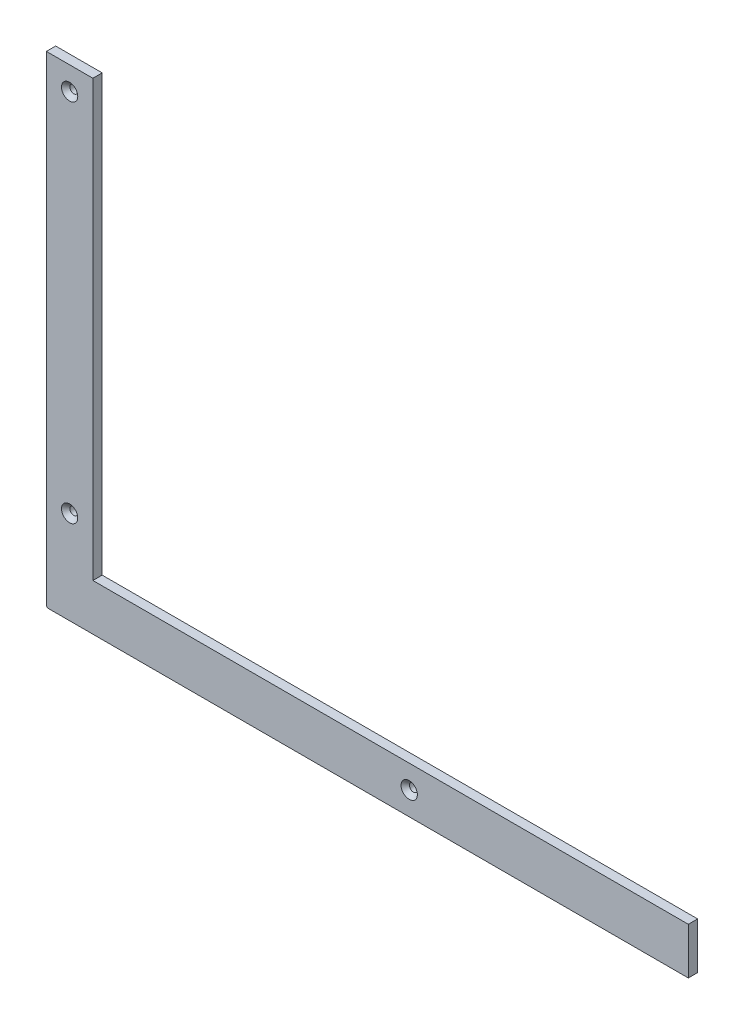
ISO-10303-21;
HEADER;
FILE_DESCRIPTION(('STEP AP214'),'2;1');
FILE_NAME('part.step','',(''),(''),'','','');
FILE_SCHEMA(('AUTOMOTIVE_DESIGN { 1 0 10303 214 1 1 1 1 }'));
ENDSEC;
DATA;
#1=APPLICATION_CONTEXT('core data for automotive mechanical design processes');
#2=APPLICATION_PROTOCOL_DEFINITION('international standard','automotive_design',2000,#1);
#3=PRODUCT_CONTEXT('',#1,'mechanical');
#4=PRODUCT('Part','Part','',(#3));
#5=PRODUCT_RELATED_PRODUCT_CATEGORY('part','',(#4));
#6=PRODUCT_DEFINITION_FORMATION('','',#4);
#7=PRODUCT_DEFINITION_CONTEXT('part definition',#1,'design');
#8=PRODUCT_DEFINITION('design','',#6,#7);
#9=PRODUCT_DEFINITION_SHAPE('','',#8);
#10=(LENGTH_UNIT() NAMED_UNIT(*) SI_UNIT(.MILLI.,.METRE.));
#11=(NAMED_UNIT(*) PLANE_ANGLE_UNIT() SI_UNIT($,.RADIAN.));
#12=(NAMED_UNIT(*) SI_UNIT($,.STERADIAN.) SOLID_ANGLE_UNIT());
#13=UNCERTAINTY_MEASURE_WITH_UNIT(LENGTH_MEASURE(1.E-05),#10,'distance_accuracy_value','');
#14=(GEOMETRIC_REPRESENTATION_CONTEXT(3) GLOBAL_UNCERTAINTY_ASSIGNED_CONTEXT((#13)) GLOBAL_UNIT_ASSIGNED_CONTEXT((#10,
#11,#12)) REPRESENTATION_CONTEXT('',''));
#15=CARTESIAN_POINT('',(0.,0.,0.));
#16=DIRECTION('',(0.,0.,1.));
#17=DIRECTION('',(1.,0.,0.));
#18=AXIS2_PLACEMENT_3D('',#15,#16,#17);
#19=CARTESIAN_POINT('',(0.,0.,8.));
#20=DIRECTION('',(0.,0.,-1.));
#21=DIRECTION('',(-1.,0.,0.));
#22=AXIS2_PLACEMENT_3D('',#19,#20,#21);
#23=PLANE('',#22);
#24=CARTESIAN_POINT('',(-256.,0.,8.));
#25=DIRECTION('',(0.,0.,1.));
#26=DIRECTION('',(1.,0.,0.));
#27=AXIS2_PLACEMENT_3D('',#24,#25,#26);
#28=CIRCLE('',#27,3.5);
#29=CARTESIAN_POINT('',(-252.5,0.,8.));
#30=VERTEX_POINT('',#29);
#31=EDGE_CURVE('E193',#30,#30,#28,.T.);
#32=ORIENTED_EDGE('',*,*,#31,.F.);
#33=EDGE_LOOP('',(#32));
#34=FACE_BOUND('',#33,.T.);
#35=CARTESIAN_POINT('',(-256.,-157.,8.));
#36=DIRECTION('',(0.,0.,1.));
#37=DIRECTION('',(1.,0.,0.));
#38=AXIS2_PLACEMENT_3D('',#35,#36,#37);
#39=CIRCLE('',#38,3.5);
#40=CARTESIAN_POINT('',(-252.5,-157.,8.));
#41=VERTEX_POINT('',#40);
#42=EDGE_CURVE('E198',#41,#41,#39,.T.);
#43=ORIENTED_EDGE('',*,*,#42,.F.);
#44=EDGE_LOOP('',(#43));
#45=FACE_BOUND('',#44,.T.);
#46=CARTESIAN_POINT('',(-110.,-187.,8.));
#47=DIRECTION('',(0.,0.,1.));
#48=DIRECTION('',(1.,0.,0.));
#49=AXIS2_PLACEMENT_3D('',#46,#47,#48);
#50=CIRCLE('',#49,3.5);
#51=CARTESIAN_POINT('',(-106.5,-187.,8.));
#52=VERTEX_POINT('',#51);
#53=EDGE_CURVE('E208',#52,#52,#50,.T.);
#54=ORIENTED_EDGE('',*,*,#53,.F.);
#55=EDGE_LOOP('',(#54));
#56=FACE_BOUND('',#55,.T.);
#57=DIRECTION('',(1.,0.,0.));
#58=VECTOR('',#57,1.);
#59=CARTESIAN_POINT('',(-266.,-197.,8.));
#60=LINE('',#59,#58);
#61=CARTESIAN_POINT('',(-265.,-197.,8.));
#62=VERTEX_POINT('',#61);
#63=CARTESIAN_POINT('',(10.,-197.,8.00000000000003));
#64=VERTEX_POINT('',#63);
#65=EDGE_CURVE('E165',#62,#64,#60,.T.);
#66=ORIENTED_EDGE('',*,*,#65,.T.);
#67=DIRECTION('',(0.,1.,0.));
#68=VECTOR('',#67,1.);
#69=CARTESIAN_POINT('',(10.,-197.,8.00000000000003));
#70=LINE('',#69,#68);
#71=CARTESIAN_POINT('',(10.,-177.,8.00000000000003));
#72=VERTEX_POINT('',#71);
#73=EDGE_CURVE('E261',#64,#72,#70,.T.);
#74=ORIENTED_EDGE('',*,*,#73,.T.);
#75=DIRECTION('',(1.,0.,0.));
#76=VECTOR('',#75,1.);
#77=CARTESIAN_POINT('',(-246.,-177.,8.));
#78=LINE('',#77,#76);
#79=CARTESIAN_POINT('',(-246.,-177.,8.));
#80=VERTEX_POINT('',#79);
#81=EDGE_CURVE('E250',#80,#72,#78,.T.);
#82=ORIENTED_EDGE('',*,*,#81,.F.);
#83=DIRECTION('',(0.,-1.,0.));
#84=VECTOR('',#83,1.);
#85=CARTESIAN_POINT('',(-246.,-177.,8.));
#86=LINE('',#85,#84);
#87=CARTESIAN_POINT('',(-246.,10.,7.99999999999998));
#88=VERTEX_POINT('',#87);
#89=EDGE_CURVE('E247',#88,#80,#86,.T.);
#90=ORIENTED_EDGE('',*,*,#89,.F.);
#91=DIRECTION('',(1.,0.,0.));
#92=VECTOR('',#91,1.);
#93=CARTESIAN_POINT('',(-266.,10.,7.99999999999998));
#94=LINE('',#93,#92);
#95=CARTESIAN_POINT('',(-266.,10.,7.99999999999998));
#96=VERTEX_POINT('',#95);
#97=EDGE_CURVE('E282',#96,#88,#94,.T.);
#98=ORIENTED_EDGE('',*,*,#97,.F.);
#99=DIRECTION('',(0.,-1.,0.));
#100=VECTOR('',#99,1.);
#101=CARTESIAN_POINT('',(-266.,-197.,8.));
#102=LINE('',#101,#100);
#103=CARTESIAN_POINT('',(-266.,-196.,8.));
#104=VERTEX_POINT('',#103);
#105=EDGE_CURVE('E159',#96,#104,#102,.T.);
#106=ORIENTED_EDGE('',*,*,#105,.T.);
#107=CARTESIAN_POINT('',(-265.,-196.,8.));
#108=DIRECTION('',(0.,0.,-1.));
#109=DIRECTION('',(-1.,0.,0.));
#110=AXIS2_PLACEMENT_3D('',#107,#108,#109);
#111=CIRCLE('',#110,1.);
#112=EDGE_CURVE('E178',#104,#62,#111,.F.);
#113=ORIENTED_EDGE('',*,*,#112,.T.);
#114=EDGE_LOOP('',(#66,#74,#82,#90,#98,#106,#113));
#115=FACE_BOUND('',#114,.T.);
#116=ADVANCED_FACE('F42',(#34,#45,#56,#115),#23,.F.);
#117=CARTESIAN_POINT('',(0.,0.,0.));
#118=DIRECTION('',(0.,0.,-1.));
#119=DIRECTION('',(-1.,0.,0.));
#120=AXIS2_PLACEMENT_3D('',#117,#118,#119);
#121=PLANE('',#120);
#122=DIRECTION('',(0.,1.,0.));
#123=VECTOR('',#122,1.);
#124=CARTESIAN_POINT('',(-10.,-197.,0.));
#125=LINE('',#124,#123);
#126=CARTESIAN_POINT('',(-10.,-197.,0.));
#127=VERTEX_POINT('',#126);
#128=CARTESIAN_POINT('',(-10.,-189.5,0.));
#129=VERTEX_POINT('',#128);
#130=EDGE_CURVE('E58',#127,#129,#125,.T.);
#131=ORIENTED_EDGE('',*,*,#130,.F.);
#132=DIRECTION('',(1.,0.,0.));
#133=VECTOR('',#132,1.);
#134=CARTESIAN_POINT('',(-266.,-197.,0.));
#135=LINE('',#134,#133);
#136=CARTESIAN_POINT('',(-265.,-197.,0.));
#137=VERTEX_POINT('',#136);
#138=EDGE_CURVE('E147',#137,#127,#135,.T.);
#139=ORIENTED_EDGE('',*,*,#138,.F.);
#140=CARTESIAN_POINT('',(-265.,-196.,0.));
#141=DIRECTION('',(0.,0.,-1.));
#142=DIRECTION('',(-1.,0.,0.));
#143=AXIS2_PLACEMENT_3D('',#140,#141,#142);
#144=CIRCLE('',#143,1.);
#145=CARTESIAN_POINT('',(-266.,-196.,0.));
#146=VERTEX_POINT('',#145);
#147=EDGE_CURVE('E175',#137,#146,#144,.T.);
#148=ORIENTED_EDGE('',*,*,#147,.T.);
#149=DIRECTION('',(0.,-1.,0.));
#150=VECTOR('',#149,1.);
#151=CARTESIAN_POINT('',(-266.,-197.,0.));
#152=LINE('',#151,#150);
#153=CARTESIAN_POINT('',(-266.,-10.,0.));
#154=VERTEX_POINT('',#153);
#155=EDGE_CURVE('E160',#154,#146,#152,.T.);
#156=ORIENTED_EDGE('',*,*,#155,.F.);
#157=DIRECTION('',(1.,0.,0.));
#158=VECTOR('',#157,1.);
#159=CARTESIAN_POINT('',(-266.,-10.,0.));
#160=LINE('',#159,#158);
#161=CARTESIAN_POINT('',(-258.5,-10.,0.));
#162=VERTEX_POINT('',#161);
#163=EDGE_CURVE('E269',#154,#162,#160,.T.);
#164=ORIENTED_EDGE('',*,*,#163,.T.);
#165=DIRECTION('',(0.,1.,0.));
#166=VECTOR('',#165,1.);
#167=CARTESIAN_POINT('',(-258.5,189.5,0.));
#168=LINE('',#167,#166);
#169=CARTESIAN_POINT('',(-258.5,-189.5,0.));
#170=VERTEX_POINT('',#169);
#171=EDGE_CURVE('E232',#170,#162,#168,.T.);
#172=ORIENTED_EDGE('',*,*,#171,.F.);
#173=DIRECTION('',(-1.,0.,0.));
#174=VECTOR('',#173,1.);
#175=CARTESIAN_POINT('',(258.5,-189.5,0.));
#176=LINE('',#175,#174);
#177=EDGE_CURVE('E149',#129,#170,#176,.T.);
#178=ORIENTED_EDGE('',*,*,#177,.F.);
#179=EDGE_LOOP('',(#131,#139,#148,#156,#164,#172,#178));
#180=FACE_BOUND('',#179,.T.);
#181=ADVANCED_FACE('F145',(#180),#121,.T.);
#182=CARTESIAN_POINT('',(0.,0.,4.));
#183=DIRECTION('',(0.,0.,-1.));
#184=DIRECTION('',(-1.,0.,0.));
#185=AXIS2_PLACEMENT_3D('',#182,#183,#184);
#186=PLANE('',#185);
#187=DIRECTION('',(0.,1.,0.));
#188=VECTOR('',#187,1.);
#189=CARTESIAN_POINT('',(-246.,-177.,4.));
#190=LINE('',#189,#188);
#191=CARTESIAN_POINT('',(-246.,-177.,4.));
#192=VERTEX_POINT('',#191);
#193=CARTESIAN_POINT('',(-246.,10.,4.));
#194=VERTEX_POINT('',#193);
#195=EDGE_CURVE('E65',#192,#194,#190,.T.);
#196=ORIENTED_EDGE('',*,*,#195,.F.);
#197=DIRECTION('',(-1.,0.,0.));
#198=VECTOR('',#197,1.);
#199=CARTESIAN_POINT('',(-246.,-177.,4.));
#200=LINE('',#199,#198);
#201=CARTESIAN_POINT('',(10.,-177.,4.));
#202=VERTEX_POINT('',#201);
#203=EDGE_CURVE('E51',#202,#192,#200,.T.);
#204=ORIENTED_EDGE('',*,*,#203,.F.);
#205=DIRECTION('',(0.,1.,0.));
#206=VECTOR('',#205,1.);
#207=CARTESIAN_POINT('',(10.,-197.,4.));
#208=LINE('',#207,#206);
#209=CARTESIAN_POINT('',(10.,-197.,4.));
#210=VERTEX_POINT('',#209);
#211=EDGE_CURVE('E357',#210,#202,#208,.T.);
#212=ORIENTED_EDGE('',*,*,#211,.F.);
#213=DIRECTION('',(1.,0.,0.));
#214=VECTOR('',#213,1.);
#215=CARTESIAN_POINT('',(10.,-197.,4.));
#216=LINE('',#215,#214);
#217=CARTESIAN_POINT('',(-10.,-197.,4.));
#218=VERTEX_POINT('',#217);
#219=EDGE_CURVE('E140',#218,#210,#216,.T.);
#220=ORIENTED_EDGE('',*,*,#219,.F.);
#221=DIRECTION('',(0.,1.,0.));
#222=VECTOR('',#221,1.);
#223=CARTESIAN_POINT('',(-10.,-197.,4.));
#224=LINE('',#223,#222);
#225=CARTESIAN_POINT('',(-10.,-189.5,4.));
#226=VERTEX_POINT('',#225);
#227=EDGE_CURVE('E134',#218,#226,#224,.T.);
#228=ORIENTED_EDGE('',*,*,#227,.T.);
#229=DIRECTION('',(-1.,0.,0.));
#230=VECTOR('',#229,1.);
#231=CARTESIAN_POINT('',(258.5,-189.5,4.));
#232=LINE('',#231,#230);
#233=CARTESIAN_POINT('',(-258.5,-189.5,4.));
#234=VERTEX_POINT('',#233);
#235=EDGE_CURVE('E228',#226,#234,#232,.T.);
#236=ORIENTED_EDGE('',*,*,#235,.T.);
#237=DIRECTION('',(0.,1.,0.));
#238=VECTOR('',#237,1.);
#239=CARTESIAN_POINT('',(-258.5,189.5,4.));
#240=LINE('',#239,#238);
#241=CARTESIAN_POINT('',(-258.5,-10.,4.));
#242=VERTEX_POINT('',#241);
#243=EDGE_CURVE('E231',#234,#242,#240,.T.);
#244=ORIENTED_EDGE('',*,*,#243,.T.);
#245=DIRECTION('',(1.,0.,0.));
#246=VECTOR('',#245,1.);
#247=CARTESIAN_POINT('',(-266.,-10.,4.));
#248=LINE('',#247,#246);
#249=CARTESIAN_POINT('',(-266.,-10.,4.));
#250=VERTEX_POINT('',#249);
#251=EDGE_CURVE('E296',#250,#242,#248,.T.);
#252=ORIENTED_EDGE('',*,*,#251,.F.);
#253=DIRECTION('',(0.,-1.,0.));
#254=VECTOR('',#253,1.);
#255=CARTESIAN_POINT('',(-266.,10.,4.));
#256=LINE('',#255,#254);
#257=CARTESIAN_POINT('',(-266.,10.,4.));
#258=VERTEX_POINT('',#257);
#259=EDGE_CURVE('E279',#258,#250,#256,.T.);
#260=ORIENTED_EDGE('',*,*,#259,.F.);
#261=DIRECTION('',(1.,0.,0.));
#262=VECTOR('',#261,1.);
#263=CARTESIAN_POINT('',(-266.,10.,4.));
#264=LINE('',#263,#262);
#265=EDGE_CURVE('E287',#258,#194,#264,.T.);
#266=ORIENTED_EDGE('',*,*,#265,.T.);
#267=EDGE_LOOP('',(#196,#204,#212,#220,#228,#236,#244,#252,#260,#266));
#268=FACE_BOUND('',#267,.T.);
#269=CARTESIAN_POINT('',(-110.,-187.,4.));
#270=DIRECTION('',(0.,0.,-1.));
#271=DIRECTION('',(-1.,0.,0.));
#272=AXIS2_PLACEMENT_3D('',#269,#270,#271);
#273=CIRCLE('',#272,1.69999999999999);
#274=CARTESIAN_POINT('',(-111.7,-187.,4.));
#275=VERTEX_POINT('',#274);
#276=EDGE_CURVE('E195',#275,#275,#273,.T.);
#277=ORIENTED_EDGE('',*,*,#276,.F.);
#278=EDGE_LOOP('',(#277));
#279=FACE_BOUND('',#278,.T.);
#280=CARTESIAN_POINT('',(-256.,-157.,4.));
#281=DIRECTION('',(0.,0.,-1.));
#282=DIRECTION('',(-1.,0.,0.));
#283=AXIS2_PLACEMENT_3D('',#280,#281,#282);
#284=CIRCLE('',#283,1.69999999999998);
#285=CARTESIAN_POINT('',(-257.7,-157.,4.));
#286=VERTEX_POINT('',#285);
#287=EDGE_CURVE('E190',#286,#286,#284,.T.);
#288=ORIENTED_EDGE('',*,*,#287,.F.);
#289=EDGE_LOOP('',(#288));
#290=FACE_BOUND('',#289,.T.);
#291=CARTESIAN_POINT('',(-256.,0.,4.));
#292=DIRECTION('',(0.,0.,-1.));
#293=DIRECTION('',(-1.,0.,0.));
#294=AXIS2_PLACEMENT_3D('',#291,#292,#293);
#295=CIRCLE('',#294,1.69999999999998);
#296=CARTESIAN_POINT('',(-257.7,0.,4.));
#297=VERTEX_POINT('',#296);
#298=EDGE_CURVE('E185',#297,#297,#295,.T.);
#299=ORIENTED_EDGE('',*,*,#298,.F.);
#300=EDGE_LOOP('',(#299));
#301=FACE_BOUND('',#300,.T.);
#302=ADVANCED_FACE('F310',(#268,#279,#290,#301),#186,.T.);
#303=CARTESIAN_POINT('',(-246.,-177.,8.));
#304=DIRECTION('',(1.,0.,0.));
#305=DIRECTION('',(0.,0.,-1.));
#306=AXIS2_PLACEMENT_3D('',#303,#304,#305);
#307=PLANE('',#306);
#308=DIRECTION('',(0.,0.,-1.));
#309=VECTOR('',#308,1.);
#310=CARTESIAN_POINT('',(-246.,10.,7.99999999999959));
#311=LINE('',#310,#309);
#312=EDGE_CURVE('E295',#88,#194,#311,.T.);
#313=ORIENTED_EDGE('',*,*,#312,.F.);
#314=ORIENTED_EDGE('',*,*,#89,.T.);
#315=DIRECTION('',(0.,0.,-1.));
#316=VECTOR('',#315,1.);
#317=CARTESIAN_POINT('',(-246.,-177.,8.));
#318=LINE('',#317,#316);
#319=EDGE_CURVE('E167',#80,#192,#318,.T.);
#320=ORIENTED_EDGE('',*,*,#319,.T.);
#321=ORIENTED_EDGE('',*,*,#195,.T.);
#322=EDGE_LOOP('',(#313,#314,#320,#321));
#323=FACE_BOUND('',#322,.T.);
#324=ADVANCED_FACE('F338',(#323),#307,.T.);
#325=CARTESIAN_POINT('',(-246.,-177.,8.));
#326=DIRECTION('',(0.,1.,0.));
#327=DIRECTION('',(0.,0.,1.));
#328=AXIS2_PLACEMENT_3D('',#325,#326,#327);
#329=PLANE('',#328);
#330=DIRECTION('',(0.,0.,1.));
#331=VECTOR('',#330,1.);
#332=CARTESIAN_POINT('',(9.99999999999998,-177.,7.99999999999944));
#333=LINE('',#332,#331);
#334=EDGE_CURVE('E351',#202,#72,#333,.T.);
#335=ORIENTED_EDGE('',*,*,#334,.F.);
#336=ORIENTED_EDGE('',*,*,#203,.T.);
#337=ORIENTED_EDGE('',*,*,#319,.F.);
#338=ORIENTED_EDGE('',*,*,#81,.T.);
#339=EDGE_LOOP('',(#335,#336,#337,#338));
#340=FACE_BOUND('',#339,.T.);
#341=ADVANCED_FACE('F342',(#340),#329,.T.);
#342=CARTESIAN_POINT('',(-266.,-197.,8.));
#343=DIRECTION('',(1.,0.,0.));
#344=DIRECTION('',(0.,0.,-1.));
#345=AXIS2_PLACEMENT_3D('',#342,#343,#344);
#346=PLANE('',#345);
#347=ORIENTED_EDGE('',*,*,#259,.T.);
#348=DIRECTION('',(0.,0.,-1.));
#349=VECTOR('',#348,1.);
#350=CARTESIAN_POINT('',(-266.,-10.,4.));
#351=LINE('',#350,#349);
#352=EDGE_CURVE('E276',#250,#154,#351,.T.);
#353=ORIENTED_EDGE('',*,*,#352,.T.);
#354=ORIENTED_EDGE('',*,*,#155,.T.);
#355=DIRECTION('',(0.,0.,-1.));
#356=VECTOR('',#355,1.);
#357=CARTESIAN_POINT('',(-266.,-196.,8.));
#358=LINE('',#357,#356);
#359=EDGE_CURVE('E171',#146,#104,#358,.F.);
#360=ORIENTED_EDGE('',*,*,#359,.T.);
#361=ORIENTED_EDGE('',*,*,#105,.F.);
#362=DIRECTION('',(0.,0.,-1.));
#363=VECTOR('',#362,1.);
#364=CARTESIAN_POINT('',(-266.,10.,7.99999999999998));
#365=LINE('',#364,#363);
#366=EDGE_CURVE('E289',#96,#258,#365,.T.);
#367=ORIENTED_EDGE('',*,*,#366,.T.);
#368=EDGE_LOOP('',(#347,#353,#354,#360,#361,#367));
#369=FACE_BOUND('',#368,.T.);
#370=ADVANCED_FACE('F273',(#369),#346,.F.);
#371=CARTESIAN_POINT('',(-266.,-197.,8.));
#372=DIRECTION('',(0.,1.,0.));
#373=DIRECTION('',(0.,0.,1.));
#374=AXIS2_PLACEMENT_3D('',#371,#372,#373);
#375=PLANE('',#374);
#376=ORIENTED_EDGE('',*,*,#219,.T.);
#377=DIRECTION('',(0.,0.,1.));
#378=VECTOR('',#377,1.);
#379=CARTESIAN_POINT('',(10.,-197.,8.00000000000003));
#380=LINE('',#379,#378);
#381=EDGE_CURVE('E151',#210,#64,#380,.T.);
#382=ORIENTED_EDGE('',*,*,#381,.T.);
#383=ORIENTED_EDGE('',*,*,#65,.F.);
#384=DIRECTION('',(0.,0.,-1.));
#385=VECTOR('',#384,1.);
#386=CARTESIAN_POINT('',(-265.,-197.,8.));
#387=LINE('',#386,#385);
#388=EDGE_CURVE('E157',#62,#137,#387,.T.);
#389=ORIENTED_EDGE('',*,*,#388,.T.);
#390=ORIENTED_EDGE('',*,*,#138,.T.);
#391=DIRECTION('',(0.,0.,1.));
#392=VECTOR('',#391,1.);
#393=CARTESIAN_POINT('',(-10.,-197.,4.));
#394=LINE('',#393,#392);
#395=EDGE_CURVE('E131',#127,#218,#394,.T.);
#396=ORIENTED_EDGE('',*,*,#395,.T.);
#397=EDGE_LOOP('',(#376,#382,#383,#389,#390,#396));
#398=FACE_BOUND('',#397,.T.);
#399=ADVANCED_FACE('F154',(#398),#375,.F.);
#400=CARTESIAN_POINT('',(-265.,-196.,8.));
#401=DIRECTION('',(0.,0.,-1.));
#402=DIRECTION('',(-1.,0.,0.));
#403=AXIS2_PLACEMENT_3D('',#400,#401,#402);
#404=CYLINDRICAL_SURFACE('',#403,1.);
#405=ORIENTED_EDGE('',*,*,#112,.F.);
#406=ORIENTED_EDGE('',*,*,#359,.F.);
#407=ORIENTED_EDGE('',*,*,#147,.F.);
#408=ORIENTED_EDGE('',*,*,#388,.F.);
#409=EDGE_LOOP('',(#405,#406,#407,#408));
#410=FACE_BOUND('',#409,.T.);
#411=ADVANCED_FACE('F44',(#410),#404,.T.);
#412=CARTESIAN_POINT('',(-258.5,189.5,4.));
#413=DIRECTION('',(-1.,0.,0.));
#414=DIRECTION('',(0.,-1.,0.));
#415=AXIS2_PLACEMENT_3D('',#412,#413,#414);
#416=PLANE('',#415);
#417=ORIENTED_EDGE('',*,*,#171,.T.);
#418=DIRECTION('',(0.,0.,1.));
#419=VECTOR('',#418,1.);
#420=CARTESIAN_POINT('',(-258.5,-10.,4.00000000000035));
#421=LINE('',#420,#419);
#422=EDGE_CURVE('E215',#162,#242,#421,.T.);
#423=ORIENTED_EDGE('',*,*,#422,.T.);
#424=ORIENTED_EDGE('',*,*,#243,.F.);
#425=DIRECTION('',(0.,0.,-1.));
#426=VECTOR('',#425,1.);
#427=CARTESIAN_POINT('',(-258.5,-189.5,4.));
#428=LINE('',#427,#426);
#429=EDGE_CURVE('E236',#234,#170,#428,.T.);
#430=ORIENTED_EDGE('',*,*,#429,.T.);
#431=EDGE_LOOP('',(#417,#423,#424,#430));
#432=FACE_BOUND('',#431,.T.);
#433=ADVANCED_FACE('F308',(#432),#416,.F.);
#434=CARTESIAN_POINT('',(258.5,-189.5,4.));
#435=DIRECTION('',(0.,-1.,0.));
#436=DIRECTION('',(0.,0.,-1.));
#437=AXIS2_PLACEMENT_3D('',#434,#435,#436);
#438=PLANE('',#437);
#439=ORIENTED_EDGE('',*,*,#235,.F.);
#440=DIRECTION('',(0.,0.,-1.));
#441=VECTOR('',#440,1.);
#442=CARTESIAN_POINT('',(-10.,-189.5,4.00000000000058));
#443=LINE('',#442,#441);
#444=EDGE_CURVE('E11',#226,#129,#443,.T.);
#445=ORIENTED_EDGE('',*,*,#444,.T.);
#446=ORIENTED_EDGE('',*,*,#177,.T.);
#447=ORIENTED_EDGE('',*,*,#429,.F.);
#448=EDGE_LOOP('',(#439,#445,#446,#447));
#449=FACE_BOUND('',#448,.T.);
#450=ADVANCED_FACE('F315',(#449),#438,.F.);
#451=CARTESIAN_POINT('',(-256.,0.,8.));
#452=DIRECTION('',(0.,0.,1.));
#453=DIRECTION('',(1.,0.,0.));
#454=AXIS2_PLACEMENT_3D('',#451,#452,#453);
#455=CYLINDRICAL_SURFACE('',#454,1.69999999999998);
#456=ORIENTED_EDGE('',*,*,#298,.T.);
#457=EDGE_LOOP('',(#456));
#458=FACE_BOUND('',#457,.T.);
#459=CARTESIAN_POINT('',(-256.,0.,6.2));
#460=DIRECTION('',(0.,0.,1.));
#461=DIRECTION('',(1.,0.,0.));
#462=AXIS2_PLACEMENT_3D('',#459,#460,#461);
#463=CIRCLE('',#462,1.69999999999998);
#464=CARTESIAN_POINT('',(-254.3,0.,6.2));
#465=VERTEX_POINT('',#464);
#466=EDGE_CURVE('E189',#465,#465,#463,.T.);
#467=ORIENTED_EDGE('',*,*,#466,.T.);
#468=EDGE_LOOP('',(#467));
#469=FACE_BOUND('',#468,.T.);
#470=ADVANCED_FACE('F317',(#458,#469),#455,.F.);
#471=CARTESIAN_POINT('',(-256.,0.,8.));
#472=DIRECTION('',(0.,0.,1.));
#473=DIRECTION('',(1.,0.,0.));
#474=AXIS2_PLACEMENT_3D('',#471,#472,#473);
#475=CONICAL_SURFACE('',#474,3.5,0.785398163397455);
#476=ORIENTED_EDGE('',*,*,#466,.F.);
#477=EDGE_LOOP('',(#476));
#478=FACE_BOUND('',#477,.T.);
#479=ORIENTED_EDGE('',*,*,#31,.T.);
#480=EDGE_LOOP('',(#479));
#481=FACE_BOUND('',#480,.T.);
#482=ADVANCED_FACE('F323',(#478,#481),#475,.F.);
#483=CARTESIAN_POINT('',(-256.,-157.,8.));
#484=DIRECTION('',(0.,0.,1.));
#485=DIRECTION('',(1.,0.,0.));
#486=AXIS2_PLACEMENT_3D('',#483,#484,#485);
#487=CYLINDRICAL_SURFACE('',#486,1.69999999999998);
#488=ORIENTED_EDGE('',*,*,#287,.T.);
#489=EDGE_LOOP('',(#488));
#490=FACE_BOUND('',#489,.T.);
#491=CARTESIAN_POINT('',(-256.,-157.,6.2));
#492=DIRECTION('',(0.,0.,1.));
#493=DIRECTION('',(1.,0.,0.));
#494=AXIS2_PLACEMENT_3D('',#491,#492,#493);
#495=CIRCLE('',#494,1.69999999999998);
#496=CARTESIAN_POINT('',(-254.3,-157.,6.2));
#497=VERTEX_POINT('',#496);
#498=EDGE_CURVE('E194',#497,#497,#495,.T.);
#499=ORIENTED_EDGE('',*,*,#498,.T.);
#500=EDGE_LOOP('',(#499));
#501=FACE_BOUND('',#500,.T.);
#502=ADVANCED_FACE('F405',(#490,#501),#487,.F.);
#503=CARTESIAN_POINT('',(-256.,-157.,8.));
#504=DIRECTION('',(0.,0.,1.));
#505=DIRECTION('',(1.,0.,0.));
#506=AXIS2_PLACEMENT_3D('',#503,#504,#505);
#507=CONICAL_SURFACE('',#506,3.5,0.785398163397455);
#508=ORIENTED_EDGE('',*,*,#498,.F.);
#509=EDGE_LOOP('',(#508));
#510=FACE_BOUND('',#509,.T.);
#511=ORIENTED_EDGE('',*,*,#42,.T.);
#512=EDGE_LOOP('',(#511));
#513=FACE_BOUND('',#512,.T.);
#514=ADVANCED_FACE('F402',(#510,#513),#507,.F.);
#515=CARTESIAN_POINT('',(-110.,-187.,8.));
#516=DIRECTION('',(0.,0.,1.));
#517=DIRECTION('',(1.,0.,0.));
#518=AXIS2_PLACEMENT_3D('',#515,#516,#517);
#519=CYLINDRICAL_SURFACE('',#518,1.69999999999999);
#520=ORIENTED_EDGE('',*,*,#276,.T.);
#521=EDGE_LOOP('',(#520));
#522=FACE_BOUND('',#521,.T.);
#523=CARTESIAN_POINT('',(-110.,-187.,6.2));
#524=DIRECTION('',(0.,0.,1.));
#525=DIRECTION('',(1.,0.,0.));
#526=AXIS2_PLACEMENT_3D('',#523,#524,#525);
#527=CIRCLE('',#526,1.69999999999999);
#528=CARTESIAN_POINT('',(-108.3,-187.,6.2));
#529=VERTEX_POINT('',#528);
#530=EDGE_CURVE('E199',#529,#529,#527,.T.);
#531=ORIENTED_EDGE('',*,*,#530,.T.);
#532=EDGE_LOOP('',(#531));
#533=FACE_BOUND('',#532,.T.);
#534=ADVANCED_FACE('F398',(#522,#533),#519,.F.);
#535=CARTESIAN_POINT('',(-110.,-187.,8.));
#536=DIRECTION('',(0.,0.,1.));
#537=DIRECTION('',(1.,0.,0.));
#538=AXIS2_PLACEMENT_3D('',#535,#536,#537);
#539=CONICAL_SURFACE('',#538,3.5,0.785398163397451);
#540=ORIENTED_EDGE('',*,*,#530,.F.);
#541=EDGE_LOOP('',(#540));
#542=FACE_BOUND('',#541,.T.);
#543=ORIENTED_EDGE('',*,*,#53,.T.);
#544=EDGE_LOOP('',(#543));
#545=FACE_BOUND('',#544,.T.);
#546=ADVANCED_FACE('F393',(#542,#545),#539,.F.);
#547=CARTESIAN_POINT('',(-266.,-10.,4.));
#548=DIRECTION('',(0.,-1.,0.));
#549=DIRECTION('',(0.,0.,-1.));
#550=AXIS2_PLACEMENT_3D('',#547,#548,#549);
#551=PLANE('',#550);
#552=ORIENTED_EDGE('',*,*,#163,.F.);
#553=ORIENTED_EDGE('',*,*,#352,.F.);
#554=ORIENTED_EDGE('',*,*,#251,.T.);
#555=ORIENTED_EDGE('',*,*,#422,.F.);
#556=EDGE_LOOP('',(#552,#553,#554,#555));
#557=FACE_BOUND('',#556,.T.);
#558=ADVANCED_FACE('F390',(#557),#551,.F.);
#559=CARTESIAN_POINT('',(-266.,10.,7.99999999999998));
#560=DIRECTION('',(0.,-1.,0.));
#561=DIRECTION('',(0.,0.,-1.));
#562=AXIS2_PLACEMENT_3D('',#559,#560,#561);
#563=PLANE('',#562);
#564=ORIENTED_EDGE('',*,*,#312,.T.);
#565=ORIENTED_EDGE('',*,*,#265,.F.);
#566=ORIENTED_EDGE('',*,*,#366,.F.);
#567=ORIENTED_EDGE('',*,*,#97,.T.);
#568=EDGE_LOOP('',(#564,#565,#566,#567));
#569=FACE_BOUND('',#568,.T.);
#570=ADVANCED_FACE('F387',(#569),#563,.F.);
#571=CARTESIAN_POINT('',(-10.,-197.,4.));
#572=DIRECTION('',(-1.,0.,0.));
#573=DIRECTION('',(0.,0.,1.));
#574=AXIS2_PLACEMENT_3D('',#571,#572,#573);
#575=PLANE('',#574);
#576=ORIENTED_EDGE('',*,*,#227,.F.);
#577=ORIENTED_EDGE('',*,*,#395,.F.);
#578=ORIENTED_EDGE('',*,*,#130,.T.);
#579=ORIENTED_EDGE('',*,*,#444,.F.);
#580=EDGE_LOOP('',(#576,#577,#578,#579));
#581=FACE_BOUND('',#580,.T.);
#582=ADVANCED_FACE('F132',(#581),#575,.F.);
#583=CARTESIAN_POINT('',(10.,-197.,8.00000000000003));
#584=DIRECTION('',(-1.,0.,0.));
#585=DIRECTION('',(0.,0.,1.));
#586=AXIS2_PLACEMENT_3D('',#583,#584,#585);
#587=PLANE('',#586);
#588=ORIENTED_EDGE('',*,*,#334,.T.);
#589=ORIENTED_EDGE('',*,*,#73,.F.);
#590=ORIENTED_EDGE('',*,*,#381,.F.);
#591=ORIENTED_EDGE('',*,*,#211,.T.);
#592=EDGE_LOOP('',(#588,#589,#590,#591));
#593=FACE_BOUND('',#592,.T.);
#594=ADVANCED_FACE('F381',(#593),#587,.F.);
#595=CLOSED_SHELL('',(#116,#181,#302,#324,#341,#370,#399,#411,#433,#450,#470,#482,#502,#514,
#534,#546,#558,#570,#582,#594));
#596=MANIFOLD_SOLID_BREP('B2',#595);
#597=ADVANCED_BREP_SHAPE_REPRESENTATION('',(#18,#596),#14);
#598=SHAPE_DEFINITION_REPRESENTATION(#9,#597);
ENDSEC;
END-ISO-10303-21;
